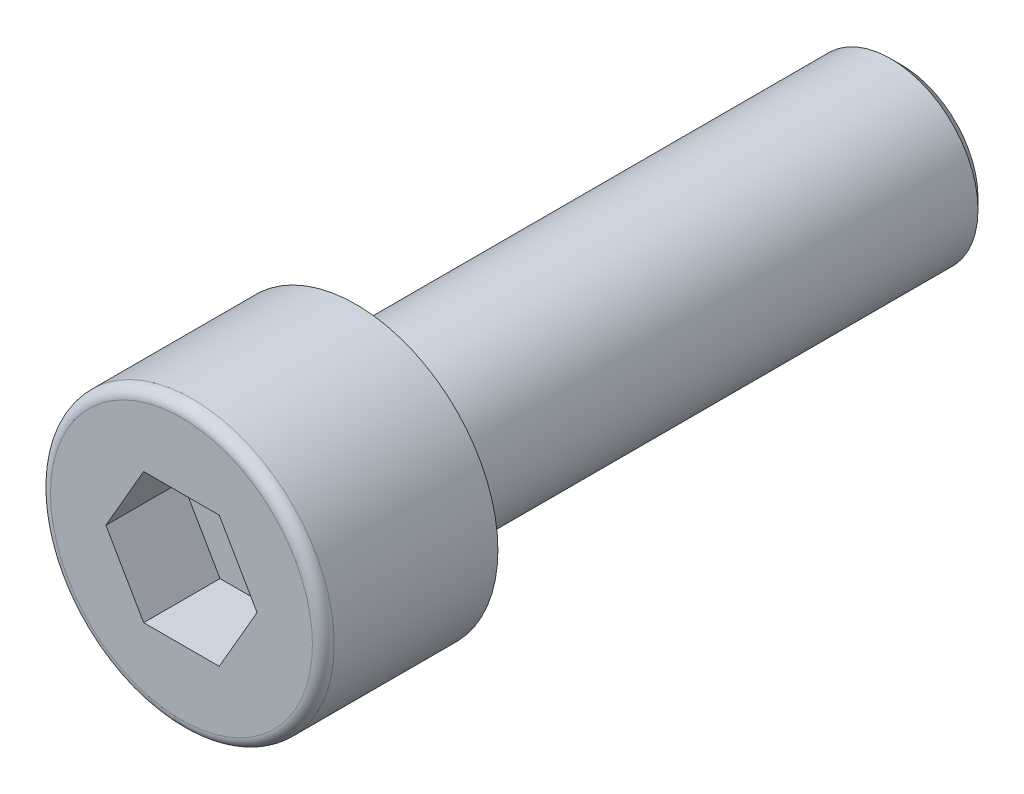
from build123d import *

# Parameters (mm, degrees)
ESQUISSE1_R             = 4
BASE_EXTRUSION_DEPTH    = 25
ESQUISSE2_R             = 6.5
BOSS_EXTRU_1_DEPTH      = 8
ENL_V_MAT_EXTRU_1_DEPTH = 3.5
CONG_2_R                = 0.5
CHANFREIN1_SIZE         = 0.5


with BuildPart() as part:
    # Esquisse1 → Base-Extrusion (new body)
    with BuildSketch(Plane.XY):
        Circle(ESQUISSE1_R)
    extrude(amount=BASE_EXTRUSION_DEPTH)

    # Esquisse2 → Boss.-Extru.1 (add)
    with BuildSketch(Plane.XY.offset(25)):
        Circle(ESQUISSE2_R)
    extrude(amount=BOSS_EXTRU_1_DEPTH)

    # Esquisse3 → Enl_v. mat.-Extru.1 (cut)
    with BuildSketch(Plane.XY.offset(33)):
        Polygon((-1.732050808, 3), (1.732050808, 3), (3.464101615, 0), (1.732050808, -3), (-1.732050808, -3), (-3.464101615, 0), align=None)
    extrude(amount=-ENL_V_MAT_EXTRU_1_DEPTH, mode=Mode.SUBTRACT)

    # Cong_2
    cong_2_edges = [part.edges().sort_by_distance(p)[0] for p in [
        (-6.5, 0, 33),
    ]]
    fillet(cong_2_edges, radius=CONG_2_R)

    # Chanfrein1
    chanfrein1_edges = [part.edges().sort_by_distance(p)[0] for p in [
        (-4, 0, 0),
    ]]
    chamfer(chanfrein1_edges, length=CHANFREIN1_SIZE)


solid = part.part
